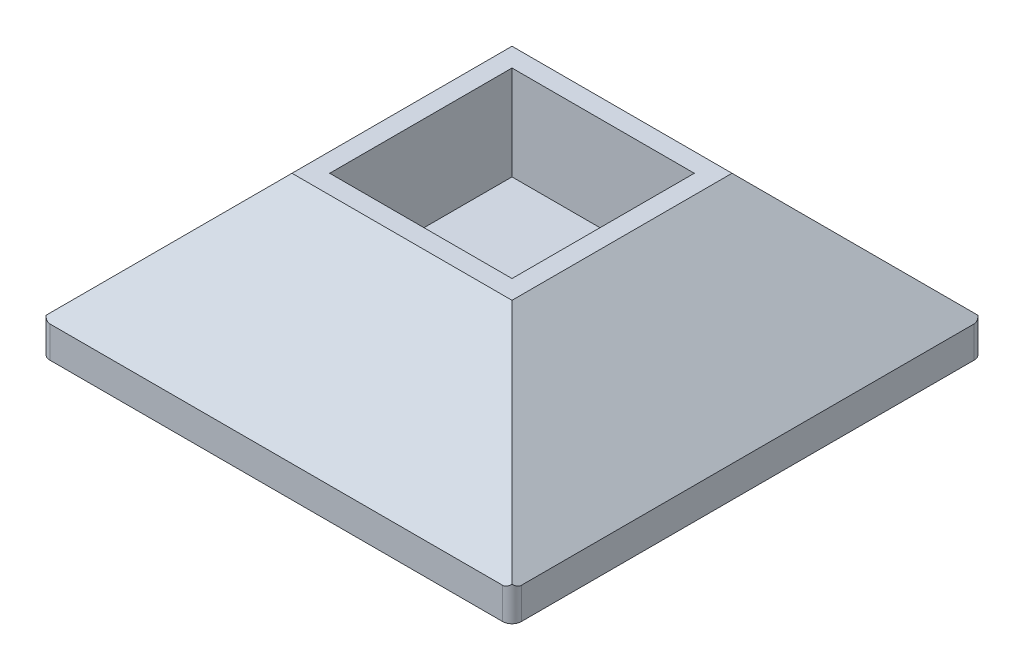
ISO-10303-21;
HEADER;
FILE_DESCRIPTION(('STEP AP214'),'2;1');
FILE_NAME('part.step','',(''),(''),'','','');
FILE_SCHEMA(('AUTOMOTIVE_DESIGN { 1 0 10303 214 1 1 1 1 }'));
ENDSEC;
DATA;
#1=APPLICATION_CONTEXT('core data for automotive mechanical design processes');
#2=APPLICATION_PROTOCOL_DEFINITION('international standard','automotive_design',2000,#1);
#3=PRODUCT_CONTEXT('',#1,'mechanical');
#4=PRODUCT('Part','Part','',(#3));
#5=PRODUCT_RELATED_PRODUCT_CATEGORY('part','',(#4));
#6=PRODUCT_DEFINITION_FORMATION('','',#4);
#7=PRODUCT_DEFINITION_CONTEXT('part definition',#1,'design');
#8=PRODUCT_DEFINITION('design','',#6,#7);
#9=PRODUCT_DEFINITION_SHAPE('','',#8);
#10=(LENGTH_UNIT() NAMED_UNIT(*) SI_UNIT(.MILLI.,.METRE.));
#11=(NAMED_UNIT(*) PLANE_ANGLE_UNIT() SI_UNIT($,.RADIAN.));
#12=(NAMED_UNIT(*) SI_UNIT($,.STERADIAN.) SOLID_ANGLE_UNIT());
#13=UNCERTAINTY_MEASURE_WITH_UNIT(LENGTH_MEASURE(1.E-05),#10,'distance_accuracy_value','');
#14=(GEOMETRIC_REPRESENTATION_CONTEXT(3) GLOBAL_UNCERTAINTY_ASSIGNED_CONTEXT((#13)) GLOBAL_UNIT_ASSIGNED_CONTEXT((#10,
#11,#12)) REPRESENTATION_CONTEXT('',''));
#15=CARTESIAN_POINT('',(0.,0.,0.));
#16=DIRECTION('',(0.,0.,1.));
#17=DIRECTION('',(1.,0.,0.));
#18=AXIS2_PLACEMENT_3D('',#15,#16,#17);
#19=CARTESIAN_POINT('',(0.,50.,0.));
#20=DIRECTION('',(1.,0.,0.));
#21=DIRECTION('',(0.,0.,-1.));
#22=AXIS2_PLACEMENT_3D('',#19,#20,#21);
#23=PLANE('',#22);
#24=DIRECTION('',(0.,0.,-1.));
#25=VECTOR('',#24,1.);
#26=CARTESIAN_POINT('',(0.,9.99999999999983,0.));
#27=LINE('',#26,#25);
#28=CARTESIAN_POINT('',(0.,9.99999999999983,147.));
#29=VERTEX_POINT('',#28);
#30=CARTESIAN_POINT('',(0.,9.99999999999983,3.));
#31=VERTEX_POINT('',#30);
#32=EDGE_CURVE('E225',#29,#31,#27,.T.);
#33=ORIENTED_EDGE('',*,*,#32,.T.);
#34=DIRECTION('',(0.,-1.,0.));
#35=VECTOR('',#34,1.);
#36=CARTESIAN_POINT('',(0.,50.,3.));
#37=LINE('',#36,#35);
#38=CARTESIAN_POINT('',(0.,0.,3.));
#39=VERTEX_POINT('',#38);
#40=EDGE_CURVE('E244',#31,#39,#37,.T.);
#41=ORIENTED_EDGE('',*,*,#40,.T.);
#42=DIRECTION('',(0.,0.,1.));
#43=VECTOR('',#42,1.);
#44=CARTESIAN_POINT('',(0.,0.,0.));
#45=LINE('',#44,#43);
#46=CARTESIAN_POINT('',(0.,0.,147.));
#47=VERTEX_POINT('',#46);
#48=EDGE_CURVE('E198',#39,#47,#45,.T.);
#49=ORIENTED_EDGE('',*,*,#48,.T.);
#50=DIRECTION('',(0.,-1.,0.));
#51=VECTOR('',#50,1.);
#52=CARTESIAN_POINT('',(0.,50.,147.));
#53=LINE('',#52,#51);
#54=EDGE_CURVE('E233',#47,#29,#53,.F.);
#55=ORIENTED_EDGE('',*,*,#54,.T.);
#56=EDGE_LOOP('',(#33,#41,#49,#55));
#57=FACE_BOUND('',#56,.T.);
#58=ADVANCED_FACE('F45',(#57),#23,.F.);
#59=CARTESIAN_POINT('',(0.,50.,150.));
#60=DIRECTION('',(0.,0.,-1.));
#61=DIRECTION('',(-1.,0.,0.));
#62=AXIS2_PLACEMENT_3D('',#59,#60,#61);
#63=PLANE('',#62);
#64=DIRECTION('',(-1.,0.,0.));
#65=VECTOR('',#64,1.);
#66=CARTESIAN_POINT('',(0.,9.99999999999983,150.));
#67=LINE('',#66,#65);
#68=CARTESIAN_POINT('',(147.,9.99999999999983,150.));
#69=VERTEX_POINT('',#68);
#70=CARTESIAN_POINT('',(3.,9.99999999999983,150.));
#71=VERTEX_POINT('',#70);
#72=EDGE_CURVE('E231',#69,#71,#67,.T.);
#73=ORIENTED_EDGE('',*,*,#72,.T.);
#74=DIRECTION('',(0.,-1.,0.));
#75=VECTOR('',#74,1.);
#76=CARTESIAN_POINT('',(3.,50.,150.));
#77=LINE('',#76,#75);
#78=CARTESIAN_POINT('',(3.,0.,150.));
#79=VERTEX_POINT('',#78);
#80=EDGE_CURVE('E278',#71,#79,#77,.T.);
#81=ORIENTED_EDGE('',*,*,#80,.T.);
#82=DIRECTION('',(1.,0.,0.));
#83=VECTOR('',#82,1.);
#84=CARTESIAN_POINT('',(0.,0.,150.));
#85=LINE('',#84,#83);
#86=CARTESIAN_POINT('',(147.,0.,150.));
#87=VERTEX_POINT('',#86);
#88=EDGE_CURVE('E204',#79,#87,#85,.T.);
#89=ORIENTED_EDGE('',*,*,#88,.T.);
#90=DIRECTION('',(0.,-1.,0.));
#91=VECTOR('',#90,1.);
#92=CARTESIAN_POINT('',(147.,50.,150.));
#93=LINE('',#92,#91);
#94=EDGE_CURVE('E65',#87,#69,#93,.F.);
#95=ORIENTED_EDGE('',*,*,#94,.T.);
#96=EDGE_LOOP('',(#73,#81,#89,#95));
#97=FACE_BOUND('',#96,.T.);
#98=ADVANCED_FACE('F350',(#97),#63,.F.);
#99=CARTESIAN_POINT('',(150.,50.,0.));
#100=DIRECTION('',(-1.,0.,0.));
#101=DIRECTION('',(0.,0.,1.));
#102=AXIS2_PLACEMENT_3D('',#99,#100,#101);
#103=PLANE('',#102);
#104=DIRECTION('',(0.,0.,-1.));
#105=VECTOR('',#104,1.);
#106=CARTESIAN_POINT('',(150.,0.,0.));
#107=LINE('',#106,#105);
#108=CARTESIAN_POINT('',(150.,0.,147.));
#109=VERTEX_POINT('',#108);
#110=CARTESIAN_POINT('',(150.,0.,3.));
#111=VERTEX_POINT('',#110);
#112=EDGE_CURVE('E206',#109,#111,#107,.T.);
#113=ORIENTED_EDGE('',*,*,#112,.T.);
#114=DIRECTION('',(0.,-1.,0.));
#115=VECTOR('',#114,1.);
#116=CARTESIAN_POINT('',(150.,50.,3.));
#117=LINE('',#116,#115);
#118=CARTESIAN_POINT('',(150.,9.99999999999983,3.));
#119=VERTEX_POINT('',#118);
#120=EDGE_CURVE('E271',#111,#119,#117,.F.);
#121=ORIENTED_EDGE('',*,*,#120,.T.);
#122=DIRECTION('',(0.,0.,1.));
#123=VECTOR('',#122,1.);
#124=CARTESIAN_POINT('',(150.,9.99999999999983,150.));
#125=LINE('',#124,#123);
#126=CARTESIAN_POINT('',(150.,9.99999999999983,147.));
#127=VERTEX_POINT('',#126);
#128=EDGE_CURVE('E228',#119,#127,#125,.T.);
#129=ORIENTED_EDGE('',*,*,#128,.T.);
#130=DIRECTION('',(0.,-1.,0.));
#131=VECTOR('',#130,1.);
#132=CARTESIAN_POINT('',(150.,50.,147.));
#133=LINE('',#132,#131);
#134=EDGE_CURVE('E268',#127,#109,#133,.T.);
#135=ORIENTED_EDGE('',*,*,#134,.T.);
#136=EDGE_LOOP('',(#113,#121,#129,#135));
#137=FACE_BOUND('',#136,.T.);
#138=ADVANCED_FACE('F294',(#137),#103,.F.);
#139=CARTESIAN_POINT('',(0.,50.,0.));
#140=DIRECTION('',(0.,0.,1.));
#141=DIRECTION('',(1.,0.,0.));
#142=AXIS2_PLACEMENT_3D('',#139,#140,#141);
#143=PLANE('',#142);
#144=DIRECTION('',(-1.,0.,0.));
#145=VECTOR('',#144,1.);
#146=CARTESIAN_POINT('',(0.,0.,0.));
#147=LINE('',#146,#145);
#148=CARTESIAN_POINT('',(147.,0.,0.));
#149=VERTEX_POINT('',#148);
#150=CARTESIAN_POINT('',(3.,0.,0.));
#151=VERTEX_POINT('',#150);
#152=EDGE_CURVE('E209',#149,#151,#147,.T.);
#153=ORIENTED_EDGE('',*,*,#152,.T.);
#154=DIRECTION('',(0.,-1.,0.));
#155=VECTOR('',#154,1.);
#156=CARTESIAN_POINT('',(3.,50.,0.));
#157=LINE('',#156,#155);
#158=CARTESIAN_POINT('',(3.,9.99999999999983,0.));
#159=VERTEX_POINT('',#158);
#160=EDGE_CURVE('E258',#151,#159,#157,.F.);
#161=ORIENTED_EDGE('',*,*,#160,.T.);
#162=DIRECTION('',(1.,0.,0.));
#163=VECTOR('',#162,1.);
#164=CARTESIAN_POINT('',(150.,9.99999999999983,0.));
#165=LINE('',#164,#163);
#166=CARTESIAN_POINT('',(147.,9.99999999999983,0.));
#167=VERTEX_POINT('',#166);
#168=EDGE_CURVE('E222',#159,#167,#165,.T.);
#169=ORIENTED_EDGE('',*,*,#168,.T.);
#170=DIRECTION('',(0.,-1.,0.));
#171=VECTOR('',#170,1.);
#172=CARTESIAN_POINT('',(147.,50.,0.));
#173=LINE('',#172,#171);
#174=EDGE_CURVE('E255',#167,#149,#173,.T.);
#175=ORIENTED_EDGE('',*,*,#174,.T.);
#176=EDGE_LOOP('',(#153,#161,#169,#175));
#177=FACE_BOUND('',#176,.T.);
#178=ADVANCED_FACE('F307',(#177),#143,.F.);
#179=CARTESIAN_POINT('',(0.,50.,0.));
#180=DIRECTION('',(0.,1.,0.));
#181=DIRECTION('',(0.,0.,1.));
#182=AXIS2_PLACEMENT_3D('',#179,#180,#181);
#183=PLANE('',#182);
#184=DIRECTION('',(0.,0.,-1.));
#185=VECTOR('',#184,1.);
#186=CARTESIAN_POINT('',(110.,50.,0.));
#187=LINE('',#186,#185);
#188=CARTESIAN_POINT('',(110.,50.,110.));
#189=VERTEX_POINT('',#188);
#190=CARTESIAN_POINT('',(110.,50.,40.));
#191=VERTEX_POINT('',#190);
#192=EDGE_CURVE('E214',#189,#191,#187,.T.);
#193=ORIENTED_EDGE('',*,*,#192,.T.);
#194=DIRECTION('',(-1.,0.,0.));
#195=VECTOR('',#194,1.);
#196=CARTESIAN_POINT('',(0.,50.,40.));
#197=LINE('',#196,#195);
#198=CARTESIAN_POINT('',(40.,50.,40.));
#199=VERTEX_POINT('',#198);
#200=EDGE_CURVE('E219',#191,#199,#197,.T.);
#201=ORIENTED_EDGE('',*,*,#200,.T.);
#202=DIRECTION('',(0.,0.,1.));
#203=VECTOR('',#202,1.);
#204=CARTESIAN_POINT('',(40.,50.,150.));
#205=LINE('',#204,#203);
#206=CARTESIAN_POINT('',(40.,50.,110.));
#207=VERTEX_POINT('',#206);
#208=EDGE_CURVE('E216',#199,#207,#205,.T.);
#209=ORIENTED_EDGE('',*,*,#208,.T.);
#210=DIRECTION('',(1.,0.,0.));
#211=VECTOR('',#210,1.);
#212=CARTESIAN_POINT('',(150.,50.,110.));
#213=LINE('',#212,#211);
#214=EDGE_CURVE('E212',#207,#189,#213,.T.);
#215=ORIENTED_EDGE('',*,*,#214,.T.);
#216=EDGE_LOOP('',(#193,#201,#209,#215));
#217=FACE_BOUND('',#216,.T.);
#218=DIRECTION('',(0.,0.,-1.));
#219=VECTOR('',#218,1.);
#220=CARTESIAN_POINT('',(104.,50.,46.));
#221=LINE('',#220,#219);
#222=CARTESIAN_POINT('',(104.,50.,104.));
#223=VERTEX_POINT('',#222);
#224=CARTESIAN_POINT('',(104.,50.,46.));
#225=VERTEX_POINT('',#224);
#226=EDGE_CURVE('E165',#223,#225,#221,.T.);
#227=ORIENTED_EDGE('',*,*,#226,.F.);
#228=DIRECTION('',(1.,0.,0.));
#229=VECTOR('',#228,1.);
#230=CARTESIAN_POINT('',(46.,50.,104.));
#231=LINE('',#230,#229);
#232=CARTESIAN_POINT('',(46.,50.,104.));
#233=VERTEX_POINT('',#232);
#234=EDGE_CURVE('E182',#233,#223,#231,.T.);
#235=ORIENTED_EDGE('',*,*,#234,.F.);
#236=DIRECTION('',(0.,0.,1.));
#237=VECTOR('',#236,1.);
#238=CARTESIAN_POINT('',(46.,50.,46.));
#239=LINE('',#238,#237);
#240=CARTESIAN_POINT('',(46.,50.,46.));
#241=VERTEX_POINT('',#240);
#242=EDGE_CURVE('E185',#241,#233,#239,.T.);
#243=ORIENTED_EDGE('',*,*,#242,.F.);
#244=DIRECTION('',(-1.,0.,0.));
#245=VECTOR('',#244,1.);
#246=CARTESIAN_POINT('',(46.,50.,46.));
#247=LINE('',#246,#245);
#248=EDGE_CURVE('E191',#225,#241,#247,.T.);
#249=ORIENTED_EDGE('',*,*,#248,.F.);
#250=EDGE_LOOP('',(#227,#235,#243,#249));
#251=FACE_BOUND('',#250,.T.);
#252=ADVANCED_FACE('F329',(#217,#251),#183,.T.);
#253=CARTESIAN_POINT('',(0.,0.,0.));
#254=DIRECTION('',(0.,1.,0.));
#255=DIRECTION('',(0.,0.,1.));
#256=AXIS2_PLACEMENT_3D('',#253,#254,#255);
#257=PLANE('',#256);
#258=ORIENTED_EDGE('',*,*,#48,.F.);
#259=CARTESIAN_POINT('',(3.,0.,3.));
#260=DIRECTION('',(0.,1.,0.));
#261=DIRECTION('',(0.,0.,1.));
#262=AXIS2_PLACEMENT_3D('',#259,#260,#261);
#263=CIRCLE('',#262,3.);
#264=EDGE_CURVE('E253',#39,#151,#263,.F.);
#265=ORIENTED_EDGE('',*,*,#264,.T.);
#266=ORIENTED_EDGE('',*,*,#152,.F.);
#267=CARTESIAN_POINT('',(147.,0.,3.));
#268=DIRECTION('',(0.,1.,0.));
#269=DIRECTION('',(0.,0.,1.));
#270=AXIS2_PLACEMENT_3D('',#267,#268,#269);
#271=CIRCLE('',#270,3.);
#272=EDGE_CURVE('E251',#149,#111,#271,.F.);
#273=ORIENTED_EDGE('',*,*,#272,.T.);
#274=ORIENTED_EDGE('',*,*,#112,.F.);
#275=CARTESIAN_POINT('',(147.,0.,147.));
#276=DIRECTION('',(0.,1.,0.));
#277=DIRECTION('',(0.,0.,1.));
#278=AXIS2_PLACEMENT_3D('',#275,#276,#277);
#279=CIRCLE('',#278,3.);
#280=EDGE_CURVE('E247',#109,#87,#279,.F.);
#281=ORIENTED_EDGE('',*,*,#280,.T.);
#282=ORIENTED_EDGE('',*,*,#88,.F.);
#283=CARTESIAN_POINT('',(3.,0.,147.));
#284=DIRECTION('',(0.,1.,0.));
#285=DIRECTION('',(0.,0.,1.));
#286=AXIS2_PLACEMENT_3D('',#283,#284,#285);
#287=CIRCLE('',#286,3.);
#288=EDGE_CURVE('E249',#79,#47,#287,.F.);
#289=ORIENTED_EDGE('',*,*,#288,.T.);
#290=EDGE_LOOP('',(#258,#265,#266,#273,#274,#281,#282,#289));
#291=FACE_BOUND('',#290,.T.);
#292=ADVANCED_FACE('F298',(#291),#257,.F.);
#293=CARTESIAN_POINT('',(104.,20.,46.));
#294=DIRECTION('',(1.,0.,0.));
#295=DIRECTION('',(0.,0.,-1.));
#296=AXIS2_PLACEMENT_3D('',#293,#294,#295);
#297=PLANE('',#296);
#298=ORIENTED_EDGE('',*,*,#226,.T.);
#299=DIRECTION('',(0.,1.,0.));
#300=VECTOR('',#299,1.);
#301=CARTESIAN_POINT('',(104.,20.,46.));
#302=LINE('',#301,#300);
#303=CARTESIAN_POINT('',(104.,20.,46.));
#304=VERTEX_POINT('',#303);
#305=EDGE_CURVE('E158',#304,#225,#302,.T.);
#306=ORIENTED_EDGE('',*,*,#305,.F.);
#307=DIRECTION('',(0.,0.,-1.));
#308=VECTOR('',#307,1.);
#309=CARTESIAN_POINT('',(104.,20.,46.));
#310=LINE('',#309,#308);
#311=CARTESIAN_POINT('',(104.,20.,104.));
#312=VERTEX_POINT('',#311);
#313=EDGE_CURVE('E162',#312,#304,#310,.T.);
#314=ORIENTED_EDGE('',*,*,#313,.F.);
#315=DIRECTION('',(0.,1.,0.));
#316=VECTOR('',#315,1.);
#317=CARTESIAN_POINT('',(104.,20.,104.));
#318=LINE('',#317,#316);
#319=EDGE_CURVE('E196',#312,#223,#318,.T.);
#320=ORIENTED_EDGE('',*,*,#319,.T.);
#321=EDGE_LOOP('',(#298,#306,#314,#320));
#322=FACE_BOUND('',#321,.T.);
#323=ADVANCED_FACE('F160',(#322),#297,.F.);
#324=CARTESIAN_POINT('',(46.,20.,104.));
#325=DIRECTION('',(0.,0.,1.));
#326=DIRECTION('',(1.,0.,0.));
#327=AXIS2_PLACEMENT_3D('',#324,#325,#326);
#328=PLANE('',#327);
#329=ORIENTED_EDGE('',*,*,#234,.T.);
#330=ORIENTED_EDGE('',*,*,#319,.F.);
#331=DIRECTION('',(1.,0.,0.));
#332=VECTOR('',#331,1.);
#333=CARTESIAN_POINT('',(46.,20.,104.));
#334=LINE('',#333,#332);
#335=CARTESIAN_POINT('',(46.,20.,104.));
#336=VERTEX_POINT('',#335);
#337=EDGE_CURVE('E170',#336,#312,#334,.T.);
#338=ORIENTED_EDGE('',*,*,#337,.F.);
#339=DIRECTION('',(0.,1.,0.));
#340=VECTOR('',#339,1.);
#341=CARTESIAN_POINT('',(46.,20.,104.));
#342=LINE('',#341,#340);
#343=EDGE_CURVE('E199',#336,#233,#342,.T.);
#344=ORIENTED_EDGE('',*,*,#343,.T.);
#345=EDGE_LOOP('',(#329,#330,#338,#344));
#346=FACE_BOUND('',#345,.T.);
#347=ADVANCED_FACE('F339',(#346),#328,.F.);
#348=CARTESIAN_POINT('',(46.,20.,46.));
#349=DIRECTION('',(-1.,0.,0.));
#350=DIRECTION('',(0.,0.,1.));
#351=AXIS2_PLACEMENT_3D('',#348,#349,#350);
#352=PLANE('',#351);
#353=ORIENTED_EDGE('',*,*,#242,.T.);
#354=ORIENTED_EDGE('',*,*,#343,.F.);
#355=DIRECTION('',(0.,0.,1.));
#356=VECTOR('',#355,1.);
#357=CARTESIAN_POINT('',(46.,20.,46.));
#358=LINE('',#357,#356);
#359=CARTESIAN_POINT('',(46.,20.,46.));
#360=VERTEX_POINT('',#359);
#361=EDGE_CURVE('E178',#360,#336,#358,.T.);
#362=ORIENTED_EDGE('',*,*,#361,.F.);
#363=DIRECTION('',(0.,1.,0.));
#364=VECTOR('',#363,1.);
#365=CARTESIAN_POINT('',(46.,20.,46.));
#366=LINE('',#365,#364);
#367=EDGE_CURVE('E169',#360,#241,#366,.T.);
#368=ORIENTED_EDGE('',*,*,#367,.T.);
#369=EDGE_LOOP('',(#353,#354,#362,#368));
#370=FACE_BOUND('',#369,.T.);
#371=ADVANCED_FACE('F337',(#370),#352,.F.);
#372=CARTESIAN_POINT('',(46.,20.,46.));
#373=DIRECTION('',(0.,0.,-1.));
#374=DIRECTION('',(-1.,0.,0.));
#375=AXIS2_PLACEMENT_3D('',#372,#373,#374);
#376=PLANE('',#375);
#377=ORIENTED_EDGE('',*,*,#248,.T.);
#378=ORIENTED_EDGE('',*,*,#367,.F.);
#379=DIRECTION('',(-1.,0.,0.));
#380=VECTOR('',#379,1.);
#381=CARTESIAN_POINT('',(46.,20.,46.));
#382=LINE('',#381,#380);
#383=EDGE_CURVE('E173',#304,#360,#382,.T.);
#384=ORIENTED_EDGE('',*,*,#383,.F.);
#385=ORIENTED_EDGE('',*,*,#305,.T.);
#386=EDGE_LOOP('',(#377,#378,#384,#385));
#387=FACE_BOUND('',#386,.T.);
#388=ADVANCED_FACE('F174',(#387),#376,.F.);
#389=CARTESIAN_POINT('',(0.,20.,0.));
#390=DIRECTION('',(0.,1.,0.));
#391=DIRECTION('',(0.,0.,1.));
#392=AXIS2_PLACEMENT_3D('',#389,#390,#391);
#393=PLANE('',#392);
#394=ORIENTED_EDGE('',*,*,#313,.T.);
#395=ORIENTED_EDGE('',*,*,#383,.T.);
#396=ORIENTED_EDGE('',*,*,#361,.T.);
#397=ORIENTED_EDGE('',*,*,#337,.T.);
#398=EDGE_LOOP('',(#394,#395,#396,#397));
#399=FACE_BOUND('',#398,.T.);
#400=ADVANCED_FACE('F180',(#399),#393,.T.);
#401=CARTESIAN_POINT('',(0.,50.,110.));
#402=DIRECTION('',(0.,0.707106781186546,0.707106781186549));
#403=DIRECTION('',(-1.,0.,0.));
#404=AXIS2_PLACEMENT_3D('',#401,#402,#403);
#405=PLANE('',#404);
#406=DIRECTION('',(-0.577350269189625,-0.577350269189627,0.577350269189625));
#407=VECTOR('',#406,1.);
#408=CARTESIAN_POINT('',(26.6666666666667,36.6666666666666,123.333333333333));
#409=LINE('',#408,#407);
#410=CARTESIAN_POINT('',(0.878679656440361,10.8786796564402,149.12132034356));
#411=VERTEX_POINT('',#410);
#412=EDGE_CURVE('E239',#411,#207,#409,.F.);
#413=ORIENTED_EDGE('',*,*,#412,.F.);
#414=CARTESIAN_POINT('',(3.,12.9999999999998,147.));
#415=DIRECTION('',(0.,0.707106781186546,0.707106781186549));
#416=DIRECTION('',(0.,-0.707106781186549,0.707106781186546));
#417=AXIS2_PLACEMENT_3D('',#414,#415,#416);
#418=ELLIPSE('',#417,4.24264068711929,3.);
#419=EDGE_CURVE('E11',#411,#71,#418,.T.);
#420=ORIENTED_EDGE('',*,*,#419,.T.);
#421=ORIENTED_EDGE('',*,*,#72,.F.);
#422=CARTESIAN_POINT('',(147.,12.9999999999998,147.));
#423=DIRECTION('',(0.,0.707106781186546,0.707106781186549));
#424=DIRECTION('',(0.,-0.707106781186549,0.707106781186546));
#425=AXIS2_PLACEMENT_3D('',#422,#423,#424);
#426=ELLIPSE('',#425,4.24264068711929,3.);
#427=CARTESIAN_POINT('',(149.12132034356,10.8786796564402,149.12132034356));
#428=VERTEX_POINT('',#427);
#429=EDGE_CURVE('E53',#69,#428,#426,.T.);
#430=ORIENTED_EDGE('',*,*,#429,.T.);
#431=DIRECTION('',(-0.577350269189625,0.577350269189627,-0.577350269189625));
#432=VECTOR('',#431,1.);
#433=CARTESIAN_POINT('',(73.3333333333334,86.6666666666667,73.3333333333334));
#434=LINE('',#433,#432);
#435=EDGE_CURVE('E192',#189,#428,#434,.F.);
#436=ORIENTED_EDGE('',*,*,#435,.F.);
#437=ORIENTED_EDGE('',*,*,#214,.F.);
#438=EDGE_LOOP('',(#413,#420,#421,#430,#436,#437));
#439=FACE_BOUND('',#438,.T.);
#440=ADVANCED_FACE('F282',(#439),#405,.T.);
#441=CARTESIAN_POINT('',(110.,50.,0.));
#442=DIRECTION('',(0.707106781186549,0.707106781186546,0.));
#443=DIRECTION('',(0.,0.,1.));
#444=AXIS2_PLACEMENT_3D('',#441,#442,#443);
#445=PLANE('',#444);
#446=ORIENTED_EDGE('',*,*,#128,.F.);
#447=CARTESIAN_POINT('',(147.,12.9999999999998,3.));
#448=DIRECTION('',(0.707106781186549,0.707106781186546,0.));
#449=DIRECTION('',(0.707106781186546,-0.707106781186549,0.));
#450=AXIS2_PLACEMENT_3D('',#447,#448,#449);
#451=ELLIPSE('',#450,4.24264068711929,3.);
#452=CARTESIAN_POINT('',(149.12132034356,10.8786796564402,0.878679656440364));
#453=VERTEX_POINT('',#452);
#454=EDGE_CURVE('E275',#119,#453,#451,.T.);
#455=ORIENTED_EDGE('',*,*,#454,.T.);
#456=DIRECTION('',(-0.577350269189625,0.577350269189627,0.577350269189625));
#457=VECTOR('',#456,1.);
#458=CARTESIAN_POINT('',(123.333333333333,36.6666666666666,26.6666666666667));
#459=LINE('',#458,#457);
#460=EDGE_CURVE('E236',#191,#453,#459,.F.);
#461=ORIENTED_EDGE('',*,*,#460,.F.);
#462=ORIENTED_EDGE('',*,*,#192,.F.);
#463=ORIENTED_EDGE('',*,*,#435,.T.);
#464=CARTESIAN_POINT('',(147.,12.9999999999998,147.));
#465=DIRECTION('',(0.707106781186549,0.707106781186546,0.));
#466=DIRECTION('',(0.707106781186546,-0.707106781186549,0.));
#467=AXIS2_PLACEMENT_3D('',#464,#465,#466);
#468=ELLIPSE('',#467,4.24264068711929,3.);
#469=EDGE_CURVE('E273',#428,#127,#468,.T.);
#470=ORIENTED_EDGE('',*,*,#469,.T.);
#471=EDGE_LOOP('',(#446,#455,#461,#462,#463,#470));
#472=FACE_BOUND('',#471,.T.);
#473=ADVANCED_FACE('F289',(#472),#445,.T.);
#474=CARTESIAN_POINT('',(40.,50.,0.));
#475=DIRECTION('',(-0.707106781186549,0.707106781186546,0.));
#476=DIRECTION('',(0.,0.,-1.));
#477=AXIS2_PLACEMENT_3D('',#474,#475,#476);
#478=PLANE('',#477);
#479=DIRECTION('',(-0.577350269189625,-0.577350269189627,-0.577350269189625));
#480=VECTOR('',#479,1.);
#481=CARTESIAN_POINT('',(26.6666666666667,36.6666666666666,26.6666666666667));
#482=LINE('',#481,#480);
#483=CARTESIAN_POINT('',(0.878679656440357,10.8786796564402,0.878679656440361));
#484=VERTEX_POINT('',#483);
#485=EDGE_CURVE('E234',#484,#199,#482,.F.);
#486=ORIENTED_EDGE('',*,*,#485,.F.);
#487=CARTESIAN_POINT('',(3.,12.9999999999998,3.));
#488=DIRECTION('',(-0.707106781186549,0.707106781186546,0.));
#489=DIRECTION('',(-0.707106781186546,-0.707106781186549,0.));
#490=AXIS2_PLACEMENT_3D('',#487,#488,#489);
#491=ELLIPSE('',#490,4.24264068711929,3.);
#492=EDGE_CURVE('E266',#484,#31,#491,.T.);
#493=ORIENTED_EDGE('',*,*,#492,.T.);
#494=ORIENTED_EDGE('',*,*,#32,.F.);
#495=CARTESIAN_POINT('',(3.,12.9999999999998,147.));
#496=DIRECTION('',(-0.707106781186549,0.707106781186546,0.));
#497=DIRECTION('',(-0.707106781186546,-0.707106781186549,0.));
#498=AXIS2_PLACEMENT_3D('',#495,#496,#497);
#499=ELLIPSE('',#498,4.24264068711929,3.);
#500=EDGE_CURVE('E264',#29,#411,#499,.T.);
#501=ORIENTED_EDGE('',*,*,#500,.T.);
#502=ORIENTED_EDGE('',*,*,#412,.T.);
#503=ORIENTED_EDGE('',*,*,#208,.F.);
#504=EDGE_LOOP('',(#486,#493,#494,#501,#502,#503));
#505=FACE_BOUND('',#504,.T.);
#506=ADVANCED_FACE('F320',(#505),#478,.T.);
#507=CARTESIAN_POINT('',(0.,50.,40.));
#508=DIRECTION('',(0.,0.707106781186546,-0.707106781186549));
#509=DIRECTION('',(1.,0.,0.));
#510=AXIS2_PLACEMENT_3D('',#507,#508,#509);
#511=PLANE('',#510);
#512=ORIENTED_EDGE('',*,*,#168,.F.);
#513=CARTESIAN_POINT('',(3.,12.9999999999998,3.));
#514=DIRECTION('',(0.,0.707106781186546,-0.707106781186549));
#515=DIRECTION('',(0.,-0.707106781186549,-0.707106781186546));
#516=AXIS2_PLACEMENT_3D('',#513,#514,#515);
#517=ELLIPSE('',#516,4.24264068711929,3.);
#518=EDGE_CURVE('E262',#159,#484,#517,.T.);
#519=ORIENTED_EDGE('',*,*,#518,.T.);
#520=ORIENTED_EDGE('',*,*,#485,.T.);
#521=ORIENTED_EDGE('',*,*,#200,.F.);
#522=ORIENTED_EDGE('',*,*,#460,.T.);
#523=CARTESIAN_POINT('',(147.,12.9999999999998,3.));
#524=DIRECTION('',(0.,0.707106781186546,-0.707106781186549));
#525=DIRECTION('',(0.,-0.707106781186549,-0.707106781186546));
#526=AXIS2_PLACEMENT_3D('',#523,#524,#525);
#527=ELLIPSE('',#526,4.24264068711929,3.);
#528=EDGE_CURVE('E260',#453,#167,#527,.T.);
#529=ORIENTED_EDGE('',*,*,#528,.T.);
#530=EDGE_LOOP('',(#512,#519,#520,#521,#522,#529));
#531=FACE_BOUND('',#530,.T.);
#532=ADVANCED_FACE('F312',(#531),#511,.T.);
#533=CARTESIAN_POINT('',(3.,50.,3.));
#534=DIRECTION('',(0.,-1.,0.));
#535=DIRECTION('',(0.,0.,-1.));
#536=AXIS2_PLACEMENT_3D('',#533,#534,#535);
#537=CYLINDRICAL_SURFACE('',#536,3.);
#538=ORIENTED_EDGE('',*,*,#518,.F.);
#539=ORIENTED_EDGE('',*,*,#160,.F.);
#540=ORIENTED_EDGE('',*,*,#264,.F.);
#541=ORIENTED_EDGE('',*,*,#40,.F.);
#542=ORIENTED_EDGE('',*,*,#492,.F.);
#543=EDGE_LOOP('',(#538,#539,#540,#541,#542));
#544=FACE_BOUND('',#543,.T.);
#545=ADVANCED_FACE('F316',(#544),#537,.T.);
#546=CARTESIAN_POINT('',(147.,50.,3.));
#547=DIRECTION('',(0.,-1.,0.));
#548=DIRECTION('',(0.,0.,-1.));
#549=AXIS2_PLACEMENT_3D('',#546,#547,#548);
#550=CYLINDRICAL_SURFACE('',#549,3.);
#551=ORIENTED_EDGE('',*,*,#454,.F.);
#552=ORIENTED_EDGE('',*,*,#120,.F.);
#553=ORIENTED_EDGE('',*,*,#272,.F.);
#554=ORIENTED_EDGE('',*,*,#174,.F.);
#555=ORIENTED_EDGE('',*,*,#528,.F.);
#556=EDGE_LOOP('',(#551,#552,#553,#554,#555));
#557=FACE_BOUND('',#556,.T.);
#558=ADVANCED_FACE('F304',(#557),#550,.T.);
#559=CARTESIAN_POINT('',(3.,50.,147.));
#560=DIRECTION('',(0.,-1.,0.));
#561=DIRECTION('',(0.,0.,-1.));
#562=AXIS2_PLACEMENT_3D('',#559,#560,#561);
#563=CYLINDRICAL_SURFACE('',#562,3.);
#564=ORIENTED_EDGE('',*,*,#500,.F.);
#565=ORIENTED_EDGE('',*,*,#54,.F.);
#566=ORIENTED_EDGE('',*,*,#288,.F.);
#567=ORIENTED_EDGE('',*,*,#80,.F.);
#568=ORIENTED_EDGE('',*,*,#419,.F.);
#569=EDGE_LOOP('',(#564,#565,#566,#567,#568));
#570=FACE_BOUND('',#569,.T.);
#571=ADVANCED_FACE('F326',(#570),#563,.T.);
#572=CARTESIAN_POINT('',(147.,50.,147.));
#573=DIRECTION('',(0.,-1.,0.));
#574=DIRECTION('',(0.,0.,-1.));
#575=AXIS2_PLACEMENT_3D('',#572,#573,#574);
#576=CYLINDRICAL_SURFACE('',#575,3.);
#577=ORIENTED_EDGE('',*,*,#429,.F.);
#578=ORIENTED_EDGE('',*,*,#94,.F.);
#579=ORIENTED_EDGE('',*,*,#280,.F.);
#580=ORIENTED_EDGE('',*,*,#134,.F.);
#581=ORIENTED_EDGE('',*,*,#469,.F.);
#582=EDGE_LOOP('',(#577,#578,#579,#580,#581));
#583=FACE_BOUND('',#582,.T.);
#584=ADVANCED_FACE('F47',(#583),#576,.T.);
#585=CLOSED_SHELL('',(#58,#98,#138,#178,#252,#292,#323,#347,#371,#388,#400,#440,#473,#506,#532,
#545,#558,#571,#584));
#586=MANIFOLD_SOLID_BREP('B2',#585);
#587=ADVANCED_BREP_SHAPE_REPRESENTATION('',(#18,#586),#14);
#588=SHAPE_DEFINITION_REPRESENTATION(#9,#587);
ENDSEC;
END-ISO-10303-21;
